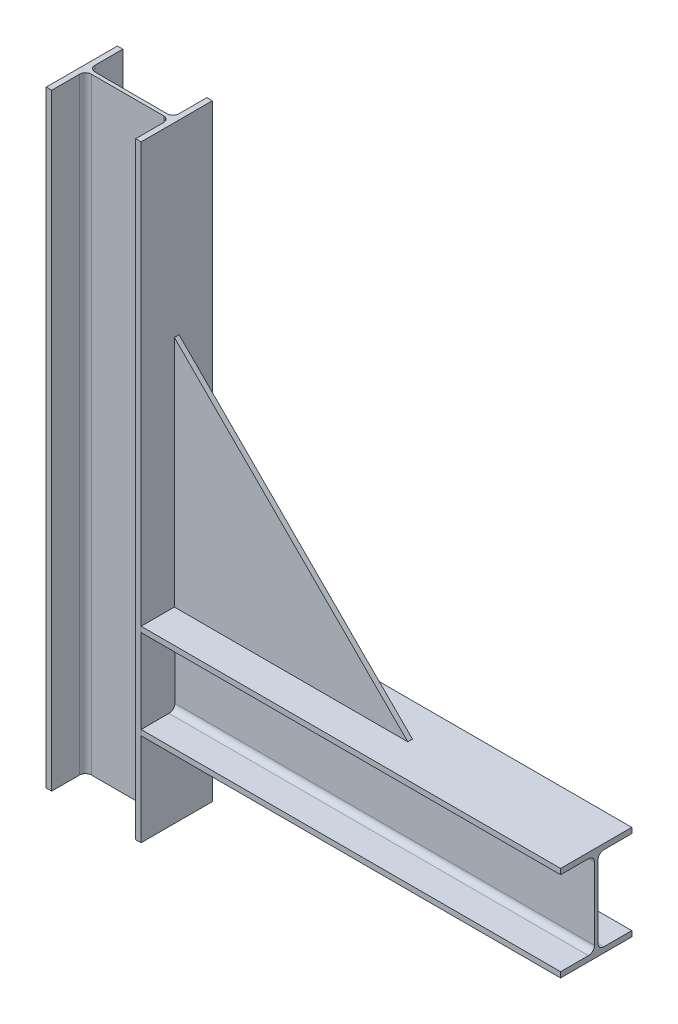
ISO-10303-21;
HEADER;
FILE_DESCRIPTION(('STEP AP214'),'2;1');
FILE_NAME('part.step','',(''),(''),'','','');
FILE_SCHEMA(('AUTOMOTIVE_DESIGN { 1 0 10303 214 1 1 1 1 }'));
ENDSEC;
DATA;
#1=APPLICATION_CONTEXT('core data for automotive mechanical design processes');
#2=APPLICATION_PROTOCOL_DEFINITION('international standard','automotive_design',2000,#1);
#3=PRODUCT_CONTEXT('',#1,'mechanical');
#4=PRODUCT('Part','Part','',(#3));
#5=PRODUCT_RELATED_PRODUCT_CATEGORY('part','',(#4));
#6=PRODUCT_DEFINITION_FORMATION('','',#4);
#7=PRODUCT_DEFINITION_CONTEXT('part definition',#1,'design');
#8=PRODUCT_DEFINITION('design','',#6,#7);
#9=PRODUCT_DEFINITION_SHAPE('','',#8);
#10=(LENGTH_UNIT() NAMED_UNIT(*) SI_UNIT(.MILLI.,.METRE.));
#11=(NAMED_UNIT(*) PLANE_ANGLE_UNIT() SI_UNIT($,.RADIAN.));
#12=(NAMED_UNIT(*) SI_UNIT($,.STERADIAN.) SOLID_ANGLE_UNIT());
#13=UNCERTAINTY_MEASURE_WITH_UNIT(LENGTH_MEASURE(1.E-05),#10,'distance_accuracy_value','');
#14=(GEOMETRIC_REPRESENTATION_CONTEXT(3) GLOBAL_UNCERTAINTY_ASSIGNED_CONTEXT((#13)) GLOBAL_UNIT_ASSIGNED_CONTEXT((#10,
#11,#12)) REPRESENTATION_CONTEXT('',''));
#15=CARTESIAN_POINT('',(0.,0.,0.));
#16=DIRECTION('',(0.,0.,1.));
#17=DIRECTION('',(1.,0.,0.));
#18=AXIS2_PLACEMENT_3D('',#15,#16,#17);
#19=CARTESIAN_POINT('',(50.8,300.8,2.50000000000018));
#20=DIRECTION('',(-0.707106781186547,-0.707106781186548,0.));
#21=DIRECTION('',(0.707106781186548,-0.707106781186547,0.));
#22=AXIS2_PLACEMENT_3D('',#19,#20,#21);
#23=PLANE('',#22);
#24=DIRECTION('',(-0.707106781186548,0.707106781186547,0.));
#25=VECTOR('',#24,1.);
#26=CARTESIAN_POINT('',(50.8,300.8,-2.49999999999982));
#27=LINE('',#26,#25);
#28=CARTESIAN_POINT('',(300.8,50.8,-2.49999999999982));
#29=VERTEX_POINT('',#28);
#30=CARTESIAN_POINT('',(50.8,300.8,-2.49999999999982));
#31=VERTEX_POINT('',#30);
#32=EDGE_CURVE('E163',#29,#31,#27,.T.);
#33=ORIENTED_EDGE('',*,*,#32,.T.);
#34=DIRECTION('',(0.,0.,-1.));
#35=VECTOR('',#34,1.);
#36=CARTESIAN_POINT('',(50.8,300.8,2.50000000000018));
#37=LINE('',#36,#35);
#38=CARTESIAN_POINT('',(50.8,300.8,2.50000000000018));
#39=VERTEX_POINT('',#38);
#40=EDGE_CURVE('E14',#39,#31,#37,.T.);
#41=ORIENTED_EDGE('',*,*,#40,.F.);
#42=DIRECTION('',(-0.707106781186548,0.707106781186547,0.));
#43=VECTOR('',#42,1.);
#44=CARTESIAN_POINT('',(50.8,300.8,2.50000000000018));
#45=LINE('',#44,#43);
#46=CARTESIAN_POINT('',(300.8,50.8,2.50000000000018));
#47=VERTEX_POINT('',#46);
#48=EDGE_CURVE('E156',#47,#39,#45,.T.);
#49=ORIENTED_EDGE('',*,*,#48,.F.);
#50=DIRECTION('',(0.,0.,-1.));
#51=VECTOR('',#50,1.);
#52=CARTESIAN_POINT('',(300.8,50.8,2.50000000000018));
#53=LINE('',#52,#51);
#54=EDGE_CURVE('E164',#47,#29,#53,.T.);
#55=ORIENTED_EDGE('',*,*,#54,.T.);
#56=EDGE_LOOP('',(#33,#41,#49,#55));
#57=FACE_BOUND('',#56,.T.);
#58=ADVANCED_FACE('F116',(#57),#23,.F.);
#59=CARTESIAN_POINT('',(50.8000000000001,50.8,2.50000000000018));
#60=DIRECTION('',(1.,0.,0.));
#61=DIRECTION('',(0.,1.,0.));
#62=AXIS2_PLACEMENT_3D('',#59,#60,#61);
#63=PLANE('',#62);
#64=DIRECTION('',(0.,-1.,0.));
#65=VECTOR('',#64,1.);
#66=CARTESIAN_POINT('',(50.8000000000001,50.8,-2.49999999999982));
#67=LINE('',#66,#65);
#68=CARTESIAN_POINT('',(50.8000000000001,50.8,-2.49999999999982));
#69=VERTEX_POINT('',#68);
#70=EDGE_CURVE('E144',#31,#69,#67,.T.);
#71=ORIENTED_EDGE('',*,*,#70,.T.);
#72=DIRECTION('',(0.,0.,-1.));
#73=VECTOR('',#72,1.);
#74=CARTESIAN_POINT('',(50.8000000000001,50.8,2.50000000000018));
#75=LINE('',#74,#73);
#76=CARTESIAN_POINT('',(50.8000000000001,50.8,2.50000000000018));
#77=VERTEX_POINT('',#76);
#78=EDGE_CURVE('E124',#77,#69,#75,.T.);
#79=ORIENTED_EDGE('',*,*,#78,.F.);
#80=DIRECTION('',(0.,-1.,0.));
#81=VECTOR('',#80,1.);
#82=CARTESIAN_POINT('',(50.8000000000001,50.8,2.50000000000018));
#83=LINE('',#82,#81);
#84=EDGE_CURVE('E152',#39,#77,#83,.T.);
#85=ORIENTED_EDGE('',*,*,#84,.F.);
#86=ORIENTED_EDGE('',*,*,#40,.T.);
#87=EDGE_LOOP('',(#71,#79,#85,#86));
#88=FACE_BOUND('',#87,.T.);
#89=ADVANCED_FACE('F153',(#88),#63,.F.);
#90=CARTESIAN_POINT('',(50.8000000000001,50.8,2.50000000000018));
#91=DIRECTION('',(0.,1.,0.));
#92=DIRECTION('',(0.,0.,1.));
#93=AXIS2_PLACEMENT_3D('',#90,#91,#92);
#94=PLANE('',#93);
#95=DIRECTION('',(1.,0.,0.));
#96=VECTOR('',#95,1.);
#97=CARTESIAN_POINT('',(50.8000000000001,50.8,-2.49999999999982));
#98=LINE('',#97,#96);
#99=EDGE_CURVE('E149',#69,#29,#98,.T.);
#100=ORIENTED_EDGE('',*,*,#99,.T.);
#101=ORIENTED_EDGE('',*,*,#54,.F.);
#102=DIRECTION('',(1.,0.,0.));
#103=VECTOR('',#102,1.);
#104=CARTESIAN_POINT('',(50.8000000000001,50.8,2.50000000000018));
#105=LINE('',#104,#103);
#106=EDGE_CURVE('E132',#77,#47,#105,.T.);
#107=ORIENTED_EDGE('',*,*,#106,.F.);
#108=ORIENTED_EDGE('',*,*,#78,.T.);
#109=EDGE_LOOP('',(#100,#101,#107,#108));
#110=FACE_BOUND('',#109,.T.);
#111=ADVANCED_FACE('F171',(#110),#94,.F.);
#112=CARTESIAN_POINT('',(0.,0.,2.50000000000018));
#113=DIRECTION('',(0.,0.,1.));
#114=DIRECTION('',(1.,0.,0.));
#115=AXIS2_PLACEMENT_3D('',#112,#113,#114);
#116=PLANE('',#115);
#117=ORIENTED_EDGE('',*,*,#48,.T.);
#118=ORIENTED_EDGE('',*,*,#84,.T.);
#119=ORIENTED_EDGE('',*,*,#106,.T.);
#120=EDGE_LOOP('',(#117,#118,#119));
#121=FACE_BOUND('',#120,.T.);
#122=ADVANCED_FACE('F159',(#121),#116,.T.);
#123=CARTESIAN_POINT('',(0.,0.,-2.49999999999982));
#124=DIRECTION('',(0.,0.,1.));
#125=DIRECTION('',(1.,0.,0.));
#126=AXIS2_PLACEMENT_3D('',#123,#124,#125);
#127=PLANE('',#126);
#128=ORIENTED_EDGE('',*,*,#32,.F.);
#129=ORIENTED_EDGE('',*,*,#99,.F.);
#130=ORIENTED_EDGE('',*,*,#70,.F.);
#131=EDGE_LOOP('',(#128,#129,#130));
#132=FACE_BOUND('',#131,.T.);
#133=ADVANCED_FACE('F172',(#132),#127,.F.);
#134=CLOSED_SHELL('',(#58,#89,#111,#122,#133));
#135=MANIFOLD_SOLID_BREP('B2',#134);
#136=CARTESIAN_POINT('',(500.,50.7999999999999,38.1000000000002));
#137=DIRECTION('',(0.,-1.,0.));
#138=DIRECTION('',(0.,0.,-1.));
#139=AXIS2_PLACEMENT_3D('',#136,#137,#138);
#140=PLANE('',#139);
#141=DIRECTION('',(0.,0.,-1.));
#142=VECTOR('',#141,1.);
#143=CARTESIAN_POINT('',(50.7999999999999,50.7999999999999,38.0999999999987));
#144=LINE('',#143,#142);
#145=CARTESIAN_POINT('',(50.7999999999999,50.7999999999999,38.1000000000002));
#146=VERTEX_POINT('',#145);
#147=CARTESIAN_POINT('',(50.8000000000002,50.8000000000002,-38.0999999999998));
#148=VERTEX_POINT('',#147);
#149=EDGE_CURVE('E347',#146,#148,#144,.T.);
#150=ORIENTED_EDGE('',*,*,#149,.F.);
#151=DIRECTION('',(-1.,0.,0.));
#152=VECTOR('',#151,1.);
#153=CARTESIAN_POINT('',(500.,50.7999999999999,38.1000000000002));
#154=LINE('',#153,#152);
#155=CARTESIAN_POINT('',(500.,50.7999999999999,38.1000000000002));
#156=VERTEX_POINT('',#155);
#157=EDGE_CURVE('E370',#156,#146,#154,.T.);
#158=ORIENTED_EDGE('',*,*,#157,.F.);
#159=DIRECTION('',(0.,0.,1.));
#160=VECTOR('',#159,1.);
#161=CARTESIAN_POINT('',(500.,50.7999999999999,38.1000000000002));
#162=LINE('',#161,#160);
#163=CARTESIAN_POINT('',(500.,50.8000000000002,-38.0999999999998));
#164=VERTEX_POINT('',#163);
#165=EDGE_CURVE('E369',#164,#156,#162,.T.);
#166=ORIENTED_EDGE('',*,*,#165,.F.);
#167=DIRECTION('',(-1.,0.,0.));
#168=VECTOR('',#167,1.);
#169=CARTESIAN_POINT('',(500.,50.8000000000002,-38.0999999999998));
#170=LINE('',#169,#168);
#171=EDGE_CURVE('E363',#164,#148,#170,.T.);
#172=ORIENTED_EDGE('',*,*,#171,.T.);
#173=EDGE_LOOP('',(#150,#158,#166,#172));
#174=FACE_BOUND('',#173,.T.);
#175=ADVANCED_FACE('F233',(#174),#140,.F.);
#176=CARTESIAN_POINT('',(500.,44.9579999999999,38.1000000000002));
#177=DIRECTION('',(0.,0.,-1.));
#178=DIRECTION('',(0.,1.,0.));
#179=AXIS2_PLACEMENT_3D('',#176,#177,#178);
#180=PLANE('',#179);
#181=DIRECTION('',(0.,1.,0.));
#182=VECTOR('',#181,1.);
#183=CARTESIAN_POINT('',(50.8,-150.,38.1000000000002));
#184=LINE('',#183,#182);
#185=CARTESIAN_POINT('',(50.7999999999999,44.9579999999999,38.1000000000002));
#186=VERTEX_POINT('',#185);
#187=EDGE_CURVE('E114',#186,#146,#184,.T.);
#188=ORIENTED_EDGE('',*,*,#187,.F.);
#189=DIRECTION('',(-1.,0.,0.));
#190=VECTOR('',#189,1.);
#191=CARTESIAN_POINT('',(500.,44.9579999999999,38.1000000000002));
#192=LINE('',#191,#190);
#193=CARTESIAN_POINT('',(500.,44.9579999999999,38.1000000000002));
#194=VERTEX_POINT('',#193);
#195=EDGE_CURVE('E372',#194,#186,#192,.T.);
#196=ORIENTED_EDGE('',*,*,#195,.F.);
#197=DIRECTION('',(0.,-1.,0.));
#198=VECTOR('',#197,1.);
#199=CARTESIAN_POINT('',(500.,44.9579999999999,38.1000000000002));
#200=LINE('',#199,#198);
#201=EDGE_CURVE('E385',#156,#194,#200,.T.);
#202=ORIENTED_EDGE('',*,*,#201,.F.);
#203=ORIENTED_EDGE('',*,*,#157,.T.);
#204=EDGE_LOOP('',(#188,#196,#202,#203));
#205=FACE_BOUND('',#204,.T.);
#206=ADVANCED_FACE('F501',(#205),#180,.F.);
#207=CARTESIAN_POINT('',(500.,44.9579999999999,8.25500000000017));
#208=DIRECTION('',(0.,1.,0.));
#209=DIRECTION('',(0.,0.,1.));
#210=AXIS2_PLACEMENT_3D('',#207,#208,#209);
#211=PLANE('',#210);
#212=DIRECTION('',(0.,0.,1.));
#213=VECTOR('',#212,1.);
#214=CARTESIAN_POINT('',(50.8,44.9579999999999,8.25499999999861));
#215=LINE('',#214,#213);
#216=CARTESIAN_POINT('',(50.8,44.958,8.25500000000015));
#217=VERTEX_POINT('',#216);
#218=EDGE_CURVE('E242',#217,#186,#215,.T.);
#219=ORIENTED_EDGE('',*,*,#218,.F.);
#220=DIRECTION('',(-1.,0.,0.));
#221=VECTOR('',#220,1.);
#222=CARTESIAN_POINT('',(500.,44.958,8.25500000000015));
#223=LINE('',#222,#221);
#224=CARTESIAN_POINT('',(500.,44.958,8.25500000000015));
#225=VERTEX_POINT('',#224);
#226=EDGE_CURVE('E415',#225,#217,#223,.T.);
#227=ORIENTED_EDGE('',*,*,#226,.F.);
#228=DIRECTION('',(0.,0.,-1.));
#229=VECTOR('',#228,1.);
#230=CARTESIAN_POINT('',(500.,44.9579999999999,8.25500000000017));
#231=LINE('',#230,#229);
#232=EDGE_CURVE('E388',#194,#225,#231,.T.);
#233=ORIENTED_EDGE('',*,*,#232,.F.);
#234=ORIENTED_EDGE('',*,*,#195,.T.);
#235=EDGE_LOOP('',(#219,#227,#233,#234));
#236=FACE_BOUND('',#235,.T.);
#237=ADVANCED_FACE('F498',(#236),#211,.F.);
#238=CARTESIAN_POINT('',(500.,38.608,8.25500000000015));
#239=DIRECTION('',(-1.,0.,0.));
#240=DIRECTION('',(0.,0.,1.));
#241=AXIS2_PLACEMENT_3D('',#238,#239,#240);
#242=CYLINDRICAL_SURFACE('',#241,6.34999999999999);
#243=CARTESIAN_POINT('',(50.8,38.608,8.25500000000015));
#244=DIRECTION('',(-1.,0.,0.));
#245=DIRECTION('',(0.,0.,1.));
#246=AXIS2_PLACEMENT_3D('',#243,#244,#245);
#247=CIRCLE('',#246,6.34999999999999);
#248=CARTESIAN_POINT('',(50.8000000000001,38.608,1.90500000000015));
#249=VERTEX_POINT('',#248);
#250=EDGE_CURVE('E393',#249,#217,#247,.F.);
#251=ORIENTED_EDGE('',*,*,#250,.F.);
#252=DIRECTION('',(-1.,0.,0.));
#253=VECTOR('',#252,1.);
#254=CARTESIAN_POINT('',(500.,38.608,1.90500000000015));
#255=LINE('',#254,#253);
#256=CARTESIAN_POINT('',(500.,38.608,1.90500000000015));
#257=VERTEX_POINT('',#256);
#258=EDGE_CURVE('E418',#257,#249,#255,.T.);
#259=ORIENTED_EDGE('',*,*,#258,.F.);
#260=CARTESIAN_POINT('',(500.,38.608,8.25500000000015));
#261=DIRECTION('',(-1.,0.,0.));
#262=DIRECTION('',(0.,1.,0.));
#263=AXIS2_PLACEMENT_3D('',#260,#261,#262);
#264=CIRCLE('',#263,6.34999999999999);
#265=EDGE_CURVE('E495',#225,#257,#264,.T.);
#266=ORIENTED_EDGE('',*,*,#265,.F.);
#267=ORIENTED_EDGE('',*,*,#226,.T.);
#268=EDGE_LOOP('',(#251,#259,#266,#267));
#269=FACE_BOUND('',#268,.T.);
#270=ADVANCED_FACE('F492',(#269),#242,.F.);
#271=CARTESIAN_POINT('',(500.,-38.608,1.90499999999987));
#272=DIRECTION('',(0.,0.,-1.));
#273=DIRECTION('',(0.,1.,0.));
#274=AXIS2_PLACEMENT_3D('',#271,#272,#273);
#275=PLANE('',#274);
#276=DIRECTION('',(0.,1.,0.));
#277=VECTOR('',#276,1.);
#278=CARTESIAN_POINT('',(50.8000000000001,-38.6080000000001,1.90499999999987));
#279=LINE('',#278,#277);
#280=CARTESIAN_POINT('',(50.8000000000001,-38.608,1.90499999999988));
#281=VERTEX_POINT('',#280);
#282=EDGE_CURVE('E395',#281,#249,#279,.T.);
#283=ORIENTED_EDGE('',*,*,#282,.F.);
#284=DIRECTION('',(-1.,0.,0.));
#285=VECTOR('',#284,1.);
#286=CARTESIAN_POINT('',(500.,-38.608,1.90499999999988));
#287=LINE('',#286,#285);
#288=CARTESIAN_POINT('',(500.,-38.608,1.90499999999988));
#289=VERTEX_POINT('',#288);
#290=EDGE_CURVE('E421',#289,#281,#287,.T.);
#291=ORIENTED_EDGE('',*,*,#290,.F.);
#292=DIRECTION('',(0.,-1.,0.));
#293=VECTOR('',#292,1.);
#294=CARTESIAN_POINT('',(500.,-38.608,1.90499999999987));
#295=LINE('',#294,#293);
#296=EDGE_CURVE('E487',#257,#289,#295,.T.);
#297=ORIENTED_EDGE('',*,*,#296,.F.);
#298=ORIENTED_EDGE('',*,*,#258,.T.);
#299=EDGE_LOOP('',(#283,#291,#297,#298));
#300=FACE_BOUND('',#299,.T.);
#301=ADVANCED_FACE('F486',(#300),#275,.F.);
#302=CARTESIAN_POINT('',(500.,-38.608,8.25499999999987));
#303=DIRECTION('',(-1.,0.,0.));
#304=DIRECTION('',(0.,0.,1.));
#305=AXIS2_PLACEMENT_3D('',#302,#303,#304);
#306=CYLINDRICAL_SURFACE('',#305,6.34999999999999);
#307=CARTESIAN_POINT('',(50.8000000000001,-38.608,8.25499999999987));
#308=DIRECTION('',(-1.,0.,0.));
#309=DIRECTION('',(0.,0.,1.));
#310=AXIS2_PLACEMENT_3D('',#307,#308,#309);
#311=CIRCLE('',#310,6.34999999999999);
#312=CARTESIAN_POINT('',(50.8000000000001,-44.958,8.25499999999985));
#313=VERTEX_POINT('',#312);
#314=EDGE_CURVE('E397',#313,#281,#311,.F.);
#315=ORIENTED_EDGE('',*,*,#314,.F.);
#316=DIRECTION('',(-1.,0.,0.));
#317=VECTOR('',#316,1.);
#318=CARTESIAN_POINT('',(500.,-44.958,8.25499999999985));
#319=LINE('',#318,#317);
#320=CARTESIAN_POINT('',(500.,-44.958,8.25499999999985));
#321=VERTEX_POINT('',#320);
#322=EDGE_CURVE('E424',#321,#313,#319,.T.);
#323=ORIENTED_EDGE('',*,*,#322,.F.);
#324=CARTESIAN_POINT('',(500.,-38.608,8.25499999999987));
#325=DIRECTION('',(-1.,0.,0.));
#326=DIRECTION('',(0.,1.,0.));
#327=AXIS2_PLACEMENT_3D('',#324,#325,#326);
#328=CIRCLE('',#327,6.34999999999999);
#329=EDGE_CURVE('E483',#289,#321,#328,.T.);
#330=ORIENTED_EDGE('',*,*,#329,.F.);
#331=ORIENTED_EDGE('',*,*,#290,.T.);
#332=EDGE_LOOP('',(#315,#323,#330,#331));
#333=FACE_BOUND('',#332,.T.);
#334=ADVANCED_FACE('F480',(#333),#306,.F.);
#335=CARTESIAN_POINT('',(500.,-44.9580000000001,38.0999999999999));
#336=DIRECTION('',(0.,-1.,0.));
#337=DIRECTION('',(0.,0.,-1.));
#338=AXIS2_PLACEMENT_3D('',#335,#336,#337);
#339=PLANE('',#338);
#340=DIRECTION('',(0.,0.,-1.));
#341=VECTOR('',#340,1.);
#342=CARTESIAN_POINT('',(50.8,-44.9580000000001,38.0999999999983));
#343=LINE('',#342,#341);
#344=CARTESIAN_POINT('',(50.8,-44.9580000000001,38.1000000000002));
#345=VERTEX_POINT('',#344);
#346=EDGE_CURVE('E399',#345,#313,#343,.T.);
#347=ORIENTED_EDGE('',*,*,#346,.F.);
#348=DIRECTION('',(-1.,0.,0.));
#349=VECTOR('',#348,1.);
#350=CARTESIAN_POINT('',(500.,-44.9580000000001,38.0999999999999));
#351=LINE('',#350,#349);
#352=CARTESIAN_POINT('',(500.,-44.9580000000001,38.0999999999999));
#353=VERTEX_POINT('',#352);
#354=EDGE_CURVE('E427',#353,#345,#351,.T.);
#355=ORIENTED_EDGE('',*,*,#354,.F.);
#356=DIRECTION('',(0.,0.,1.));
#357=VECTOR('',#356,1.);
#358=CARTESIAN_POINT('',(500.,-44.9580000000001,38.0999999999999));
#359=LINE('',#358,#357);
#360=EDGE_CURVE('E475',#321,#353,#359,.T.);
#361=ORIENTED_EDGE('',*,*,#360,.F.);
#362=ORIENTED_EDGE('',*,*,#322,.T.);
#363=EDGE_LOOP('',(#347,#355,#361,#362));
#364=FACE_BOUND('',#363,.T.);
#365=ADVANCED_FACE('F474',(#364),#339,.F.);
#366=CARTESIAN_POINT('',(500.,-50.8000000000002,38.0999999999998));
#367=DIRECTION('',(0.,0.,-1.));
#368=DIRECTION('',(0.,1.,0.));
#369=AXIS2_PLACEMENT_3D('',#366,#367,#368);
#370=PLANE('',#369);
#371=CARTESIAN_POINT('',(50.8,-50.8000000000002,38.1000000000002));
#372=VERTEX_POINT('',#371);
#373=EDGE_CURVE('E244',#372,#345,#184,.T.);
#374=ORIENTED_EDGE('',*,*,#373,.F.);
#375=DIRECTION('',(-1.,0.,0.));
#376=VECTOR('',#375,1.);
#377=CARTESIAN_POINT('',(500.,-50.8000000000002,38.0999999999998));
#378=LINE('',#377,#376);
#379=CARTESIAN_POINT('',(500.,-50.8000000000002,38.0999999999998));
#380=VERTEX_POINT('',#379);
#381=EDGE_CURVE('E411',#380,#372,#378,.T.);
#382=ORIENTED_EDGE('',*,*,#381,.F.);
#383=DIRECTION('',(0.,-1.,0.));
#384=VECTOR('',#383,1.);
#385=CARTESIAN_POINT('',(500.,-50.8000000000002,38.0999999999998));
#386=LINE('',#385,#384);
#387=EDGE_CURVE('E470',#353,#380,#386,.T.);
#388=ORIENTED_EDGE('',*,*,#387,.F.);
#389=ORIENTED_EDGE('',*,*,#354,.T.);
#390=EDGE_LOOP('',(#374,#382,#388,#389));
#391=FACE_BOUND('',#390,.T.);
#392=ADVANCED_FACE('F469',(#391),#370,.F.);
#393=CARTESIAN_POINT('',(500.,-50.7999999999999,-38.1000000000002));
#394=DIRECTION('',(0.,1.,0.));
#395=DIRECTION('',(0.,0.,1.));
#396=AXIS2_PLACEMENT_3D('',#393,#394,#395);
#397=PLANE('',#396);
#398=DIRECTION('',(0.,0.,1.));
#399=VECTOR('',#398,1.);
#400=CARTESIAN_POINT('',(50.8000000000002,-50.7999999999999,-38.1000000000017));
#401=LINE('',#400,#399);
#402=CARTESIAN_POINT('',(50.8000000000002,-50.7999999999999,-38.0999999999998));
#403=VERTEX_POINT('',#402);
#404=EDGE_CURVE('E268',#403,#372,#401,.T.);
#405=ORIENTED_EDGE('',*,*,#404,.F.);
#406=DIRECTION('',(-1.,0.,0.));
#407=VECTOR('',#406,1.);
#408=CARTESIAN_POINT('',(500.,-50.7999999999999,-38.1000000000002));
#409=LINE('',#408,#407);
#410=CARTESIAN_POINT('',(500.,-50.7999999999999,-38.1000000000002));
#411=VERTEX_POINT('',#410);
#412=EDGE_CURVE('E410',#411,#403,#409,.T.);
#413=ORIENTED_EDGE('',*,*,#412,.F.);
#414=DIRECTION('',(0.,0.,-1.));
#415=VECTOR('',#414,1.);
#416=CARTESIAN_POINT('',(500.,-50.7999999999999,-38.1000000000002));
#417=LINE('',#416,#415);
#418=EDGE_CURVE('E465',#380,#411,#417,.T.);
#419=ORIENTED_EDGE('',*,*,#418,.F.);
#420=ORIENTED_EDGE('',*,*,#381,.T.);
#421=EDGE_LOOP('',(#405,#413,#419,#420));
#422=FACE_BOUND('',#421,.T.);
#423=ADVANCED_FACE('F464',(#422),#397,.F.);
#424=CARTESIAN_POINT('',(500.,-44.9579999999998,-38.1000000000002));
#425=DIRECTION('',(0.,0.,1.));
#426=DIRECTION('',(0.,-1.,0.));
#427=AXIS2_PLACEMENT_3D('',#424,#425,#426);
#428=PLANE('',#427);
#429=DIRECTION('',(0.,1.,0.));
#430=VECTOR('',#429,1.);
#431=CARTESIAN_POINT('',(50.8000000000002,-150.,-38.0999999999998));
#432=LINE('',#431,#430);
#433=CARTESIAN_POINT('',(50.8000000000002,-44.9579999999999,-38.0999999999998));
#434=VERTEX_POINT('',#433);
#435=EDGE_CURVE('E272',#403,#434,#432,.T.);
#436=ORIENTED_EDGE('',*,*,#435,.T.);
#437=DIRECTION('',(-1.,0.,0.));
#438=VECTOR('',#437,1.);
#439=CARTESIAN_POINT('',(500.,-44.9579999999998,-38.1000000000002));
#440=LINE('',#439,#438);
#441=CARTESIAN_POINT('',(500.,-44.9579999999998,-38.1000000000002));
#442=VERTEX_POINT('',#441);
#443=EDGE_CURVE('E434',#442,#434,#440,.T.);
#444=ORIENTED_EDGE('',*,*,#443,.F.);
#445=DIRECTION('',(0.,1.,0.));
#446=VECTOR('',#445,1.);
#447=CARTESIAN_POINT('',(500.,-44.9579999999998,-38.1000000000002));
#448=LINE('',#447,#446);
#449=EDGE_CURVE('E460',#411,#442,#448,.T.);
#450=ORIENTED_EDGE('',*,*,#449,.F.);
#451=ORIENTED_EDGE('',*,*,#412,.T.);
#452=EDGE_LOOP('',(#436,#444,#450,#451));
#453=FACE_BOUND('',#452,.T.);
#454=ADVANCED_FACE('F459',(#453),#428,.F.);
#455=CARTESIAN_POINT('',(500.,-44.9579999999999,-8.25500000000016));
#456=DIRECTION('',(0.,-1.,0.));
#457=DIRECTION('',(0.,0.,-1.));
#458=AXIS2_PLACEMENT_3D('',#455,#456,#457);
#459=PLANE('',#458);
#460=DIRECTION('',(0.,0.,-1.));
#461=VECTOR('',#460,1.);
#462=CARTESIAN_POINT('',(50.8000000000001,-44.9579999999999,-8.25500000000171));
#463=LINE('',#462,#461);
#464=CARTESIAN_POINT('',(50.8000000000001,-44.958,-8.25500000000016));
#465=VERTEX_POINT('',#464);
#466=EDGE_CURVE('E276',#465,#434,#463,.T.);
#467=ORIENTED_EDGE('',*,*,#466,.F.);
#468=DIRECTION('',(-1.,0.,0.));
#469=VECTOR('',#468,1.);
#470=CARTESIAN_POINT('',(500.,-44.958,-8.25500000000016));
#471=LINE('',#470,#469);
#472=CARTESIAN_POINT('',(500.,-44.958,-8.25500000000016));
#473=VERTEX_POINT('',#472);
#474=EDGE_CURVE('E436',#473,#465,#471,.T.);
#475=ORIENTED_EDGE('',*,*,#474,.F.);
#476=DIRECTION('',(0.,0.,1.));
#477=VECTOR('',#476,1.);
#478=CARTESIAN_POINT('',(500.,-44.9579999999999,-8.25500000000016));
#479=LINE('',#478,#477);
#480=EDGE_CURVE('E456',#442,#473,#479,.T.);
#481=ORIENTED_EDGE('',*,*,#480,.F.);
#482=ORIENTED_EDGE('',*,*,#443,.T.);
#483=EDGE_LOOP('',(#467,#475,#481,#482));
#484=FACE_BOUND('',#483,.T.);
#485=ADVANCED_FACE('F453',(#484),#459,.F.);
#486=CARTESIAN_POINT('',(500.,-38.608,-8.25500000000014));
#487=DIRECTION('',(-1.,0.,0.));
#488=DIRECTION('',(0.,0.,1.));
#489=AXIS2_PLACEMENT_3D('',#486,#487,#488);
#490=CYLINDRICAL_SURFACE('',#489,6.34999999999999);
#491=CARTESIAN_POINT('',(50.8000000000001,-38.608,-8.25500000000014));
#492=DIRECTION('',(-1.,0.,0.));
#493=DIRECTION('',(0.,0.,1.));
#494=AXIS2_PLACEMENT_3D('',#491,#492,#493);
#495=CIRCLE('',#494,6.34999999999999);
#496=CARTESIAN_POINT('',(50.8,-38.608,-1.90500000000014));
#497=VERTEX_POINT('',#496);
#498=EDGE_CURVE('E403',#497,#465,#495,.F.);
#499=ORIENTED_EDGE('',*,*,#498,.F.);
#500=DIRECTION('',(-1.,0.,0.));
#501=VECTOR('',#500,1.);
#502=CARTESIAN_POINT('',(500.,-38.608,-1.90500000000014));
#503=LINE('',#502,#501);
#504=CARTESIAN_POINT('',(500.,-38.608,-1.90500000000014));
#505=VERTEX_POINT('',#504);
#506=EDGE_CURVE('E376',#505,#497,#503,.T.);
#507=ORIENTED_EDGE('',*,*,#506,.F.);
#508=CARTESIAN_POINT('',(500.,-38.608,-8.25500000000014));
#509=DIRECTION('',(-1.,0.,0.));
#510=DIRECTION('',(0.,1.,0.));
#511=AXIS2_PLACEMENT_3D('',#508,#509,#510);
#512=CIRCLE('',#511,6.34999999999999);
#513=EDGE_CURVE('E451',#473,#505,#512,.T.);
#514=ORIENTED_EDGE('',*,*,#513,.F.);
#515=ORIENTED_EDGE('',*,*,#474,.T.);
#516=EDGE_LOOP('',(#499,#507,#514,#515));
#517=FACE_BOUND('',#516,.T.);
#518=ADVANCED_FACE('F450',(#517),#490,.F.);
#519=CARTESIAN_POINT('',(500.,38.608,-1.90499999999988));
#520=DIRECTION('',(0.,0.,1.));
#521=DIRECTION('',(0.,-1.,0.));
#522=AXIS2_PLACEMENT_3D('',#519,#520,#521);
#523=PLANE('',#522);
#524=DIRECTION('',(0.,-1.,0.));
#525=VECTOR('',#524,1.);
#526=CARTESIAN_POINT('',(50.8,38.6079999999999,-1.90499999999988));
#527=LINE('',#526,#525);
#528=CARTESIAN_POINT('',(50.8,38.608,-1.90499999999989));
#529=VERTEX_POINT('',#528);
#530=EDGE_CURVE('E405',#529,#497,#527,.T.);
#531=ORIENTED_EDGE('',*,*,#530,.F.);
#532=DIRECTION('',(-1.,0.,0.));
#533=VECTOR('',#532,1.);
#534=CARTESIAN_POINT('',(500.,38.608,-1.90499999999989));
#535=LINE('',#534,#533);
#536=CARTESIAN_POINT('',(500.,38.608,-1.90499999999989));
#537=VERTEX_POINT('',#536);
#538=EDGE_CURVE('E378',#537,#529,#535,.T.);
#539=ORIENTED_EDGE('',*,*,#538,.F.);
#540=DIRECTION('',(0.,1.,0.));
#541=VECTOR('',#540,1.);
#542=CARTESIAN_POINT('',(500.,38.608,-1.90499999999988));
#543=LINE('',#542,#541);
#544=EDGE_CURVE('E449',#505,#537,#543,.T.);
#545=ORIENTED_EDGE('',*,*,#544,.F.);
#546=ORIENTED_EDGE('',*,*,#506,.T.);
#547=EDGE_LOOP('',(#531,#539,#545,#546));
#548=FACE_BOUND('',#547,.T.);
#549=ADVANCED_FACE('F447',(#548),#523,.F.);
#550=CARTESIAN_POINT('',(500.,38.608,-8.25499999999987));
#551=DIRECTION('',(-1.,0.,0.));
#552=DIRECTION('',(0.,0.,1.));
#553=AXIS2_PLACEMENT_3D('',#550,#551,#552);
#554=CYLINDRICAL_SURFACE('',#553,6.34999999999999);
#555=CARTESIAN_POINT('',(50.8000000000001,38.608,-8.25499999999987));
#556=DIRECTION('',(-1.,0.,0.));
#557=DIRECTION('',(0.,0.,1.));
#558=AXIS2_PLACEMENT_3D('',#555,#556,#557);
#559=CIRCLE('',#558,6.34999999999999);
#560=CARTESIAN_POINT('',(50.8000000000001,44.958,-8.25499999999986));
#561=VERTEX_POINT('',#560);
#562=EDGE_CURVE('E407',#561,#529,#559,.F.);
#563=ORIENTED_EDGE('',*,*,#562,.F.);
#564=DIRECTION('',(-1.,0.,0.));
#565=VECTOR('',#564,1.);
#566=CARTESIAN_POINT('',(500.,44.958,-8.25499999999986));
#567=LINE('',#566,#565);
#568=CARTESIAN_POINT('',(500.,44.958,-8.25499999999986));
#569=VERTEX_POINT('',#568);
#570=EDGE_CURVE('E380',#569,#561,#567,.T.);
#571=ORIENTED_EDGE('',*,*,#570,.F.);
#572=CARTESIAN_POINT('',(500.,38.608,-8.25499999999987));
#573=DIRECTION('',(-1.,0.,0.));
#574=DIRECTION('',(0.,1.,0.));
#575=AXIS2_PLACEMENT_3D('',#572,#573,#574);
#576=CIRCLE('',#575,6.34999999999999);
#577=EDGE_CURVE('E514',#537,#569,#576,.T.);
#578=ORIENTED_EDGE('',*,*,#577,.F.);
#579=ORIENTED_EDGE('',*,*,#538,.T.);
#580=EDGE_LOOP('',(#563,#571,#578,#579));
#581=FACE_BOUND('',#580,.T.);
#582=ADVANCED_FACE('F522',(#581),#554,.F.);
#583=CARTESIAN_POINT('',(500.,44.9580000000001,-38.0999999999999));
#584=DIRECTION('',(0.,1.,0.));
#585=DIRECTION('',(0.,0.,1.));
#586=AXIS2_PLACEMENT_3D('',#583,#584,#585);
#587=PLANE('',#586);
#588=DIRECTION('',(0.,0.,1.));
#589=VECTOR('',#588,1.);
#590=CARTESIAN_POINT('',(50.8000000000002,44.9580000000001,-38.1000000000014));
#591=LINE('',#590,#589);
#592=CARTESIAN_POINT('',(50.8000000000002,44.9580000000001,-38.0999999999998));
#593=VERTEX_POINT('',#592);
#594=EDGE_CURVE('E366',#593,#561,#591,.T.);
#595=ORIENTED_EDGE('',*,*,#594,.F.);
#596=DIRECTION('',(-1.,0.,0.));
#597=VECTOR('',#596,1.);
#598=CARTESIAN_POINT('',(500.,44.9580000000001,-38.0999999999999));
#599=LINE('',#598,#597);
#600=CARTESIAN_POINT('',(500.,44.9580000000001,-38.0999999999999));
#601=VERTEX_POINT('',#600);
#602=EDGE_CURVE('E236',#601,#593,#599,.T.);
#603=ORIENTED_EDGE('',*,*,#602,.F.);
#604=DIRECTION('',(0.,0.,-1.));
#605=VECTOR('',#604,1.);
#606=CARTESIAN_POINT('',(500.,44.9580000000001,-38.0999999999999));
#607=LINE('',#606,#605);
#608=EDGE_CURVE('E516',#569,#601,#607,.T.);
#609=ORIENTED_EDGE('',*,*,#608,.F.);
#610=ORIENTED_EDGE('',*,*,#570,.T.);
#611=EDGE_LOOP('',(#595,#603,#609,#610));
#612=FACE_BOUND('',#611,.T.);
#613=ADVANCED_FACE('F519',(#612),#587,.F.);
#614=CARTESIAN_POINT('',(500.,50.8000000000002,-38.0999999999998));
#615=DIRECTION('',(0.,0.,1.));
#616=DIRECTION('',(0.,-1.,0.));
#617=AXIS2_PLACEMENT_3D('',#614,#615,#616);
#618=PLANE('',#617);
#619=DIRECTION('',(0.,-1.,0.));
#620=VECTOR('',#619,1.);
#621=CARTESIAN_POINT('',(50.8000000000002,50.8000000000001,-38.0999999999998));
#622=LINE('',#621,#620);
#623=EDGE_CURVE('E350',#148,#593,#622,.T.);
#624=ORIENTED_EDGE('',*,*,#623,.F.);
#625=ORIENTED_EDGE('',*,*,#171,.F.);
#626=DIRECTION('',(0.,1.,0.));
#627=VECTOR('',#626,1.);
#628=CARTESIAN_POINT('',(500.,50.8000000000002,-38.0999999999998));
#629=LINE('',#628,#627);
#630=EDGE_CURVE('E356',#601,#164,#629,.T.);
#631=ORIENTED_EDGE('',*,*,#630,.F.);
#632=ORIENTED_EDGE('',*,*,#602,.T.);
#633=EDGE_LOOP('',(#624,#625,#631,#632));
#634=FACE_BOUND('',#633,.T.);
#635=ADVANCED_FACE('F361',(#634),#618,.F.);
#636=CARTESIAN_POINT('',(500.,38.608,-8.25499999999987));
#637=DIRECTION('',(1.,0.,0.));
#638=DIRECTION('',(0.,1.,0.));
#639=AXIS2_PLACEMENT_3D('',#636,#637,#638);
#640=PLANE('',#639);
#641=ORIENTED_EDGE('',*,*,#165,.T.);
#642=ORIENTED_EDGE('',*,*,#201,.T.);
#643=ORIENTED_EDGE('',*,*,#232,.T.);
#644=ORIENTED_EDGE('',*,*,#265,.T.);
#645=ORIENTED_EDGE('',*,*,#296,.T.);
#646=ORIENTED_EDGE('',*,*,#329,.T.);
#647=ORIENTED_EDGE('',*,*,#360,.T.);
#648=ORIENTED_EDGE('',*,*,#387,.T.);
#649=ORIENTED_EDGE('',*,*,#418,.T.);
#650=ORIENTED_EDGE('',*,*,#449,.T.);
#651=ORIENTED_EDGE('',*,*,#480,.T.);
#652=ORIENTED_EDGE('',*,*,#513,.T.);
#653=ORIENTED_EDGE('',*,*,#544,.T.);
#654=ORIENTED_EDGE('',*,*,#577,.T.);
#655=ORIENTED_EDGE('',*,*,#608,.T.);
#656=ORIENTED_EDGE('',*,*,#630,.T.);
#657=EDGE_LOOP('',(#641,#642,#643,#644,#645,#646,#647,#648,#649,#650,#651,#652,#653,#654,#655,#656));
#658=FACE_BOUND('',#657,.T.);
#659=ADVANCED_FACE('F502',(#658),#640,.T.);
#660=CARTESIAN_POINT('',(50.8,-150.,38.1000000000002));
#661=DIRECTION('',(-1.,0.,0.));
#662=DIRECTION('',(0.,0.,1.));
#663=AXIS2_PLACEMENT_3D('',#660,#661,#662);
#664=PLANE('',#663);
#665=ORIENTED_EDGE('',*,*,#149,.T.);
#666=ORIENTED_EDGE('',*,*,#623,.T.);
#667=ORIENTED_EDGE('',*,*,#594,.T.);
#668=ORIENTED_EDGE('',*,*,#562,.T.);
#669=ORIENTED_EDGE('',*,*,#530,.T.);
#670=ORIENTED_EDGE('',*,*,#498,.T.);
#671=ORIENTED_EDGE('',*,*,#466,.T.);
#672=ORIENTED_EDGE('',*,*,#435,.F.);
#673=ORIENTED_EDGE('',*,*,#404,.T.);
#674=ORIENTED_EDGE('',*,*,#373,.T.);
#675=ORIENTED_EDGE('',*,*,#346,.T.);
#676=ORIENTED_EDGE('',*,*,#314,.T.);
#677=ORIENTED_EDGE('',*,*,#282,.T.);
#678=ORIENTED_EDGE('',*,*,#250,.T.);
#679=ORIENTED_EDGE('',*,*,#218,.T.);
#680=ORIENTED_EDGE('',*,*,#187,.T.);
#681=EDGE_LOOP('',(#665,#666,#667,#668,#669,#670,#671,#672,#673,#674,#675,#676,#677,#678,#679,#680));
#682=FACE_BOUND('',#681,.T.);
#683=ADVANCED_FACE('F349',(#682),#664,.T.);
#684=CLOSED_SHELL('',(#175,#206,#237,#270,#301,#334,#365,#392,#423,#454,#485,#518,#549,#582,
#613,#635,#659,#683));
#685=MANIFOLD_SOLID_BREP('B8',#684);
#686=CARTESIAN_POINT('',(50.8,-150.,38.1000000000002));
#687=DIRECTION('',(-1.,0.,0.));
#688=DIRECTION('',(0.,0.,1.));
#689=AXIS2_PLACEMENT_3D('',#686,#687,#688);
#690=PLANE('',#689);
#691=DIRECTION('',(0.,0.,1.));
#692=VECTOR('',#691,1.);
#693=CARTESIAN_POINT('',(50.7999999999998,500.,38.1000000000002));
#694=LINE('',#693,#692);
#695=CARTESIAN_POINT('',(50.8000000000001,500.,-38.0999999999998));
#696=VERTEX_POINT('',#695);
#697=CARTESIAN_POINT('',(50.7999999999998,500.,38.1000000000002));
#698=VERTEX_POINT('',#697);
#699=EDGE_CURVE('E906',#696,#698,#694,.T.);
#700=ORIENTED_EDGE('',*,*,#699,.T.);
#701=DIRECTION('',(0.,1.,0.));
#702=VECTOR('',#701,1.);
#703=CARTESIAN_POINT('',(50.8,-150.,38.1000000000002));
#704=LINE('',#703,#702);
#705=CARTESIAN_POINT('',(50.8,-150.,38.1000000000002));
#706=VERTEX_POINT('',#705);
#707=EDGE_CURVE('E231',#706,#698,#704,.T.);
#708=ORIENTED_EDGE('',*,*,#707,.F.);
#709=DIRECTION('',(0.,0.,1.));
#710=VECTOR('',#709,1.);
#711=CARTESIAN_POINT('',(50.8,-150.,38.1000000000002));
#712=LINE('',#711,#710);
#713=CARTESIAN_POINT('',(50.8000000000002,-150.,-38.0999999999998));
#714=VERTEX_POINT('',#713);
#715=EDGE_CURVE('E952',#714,#706,#712,.T.);
#716=ORIENTED_EDGE('',*,*,#715,.F.);
#717=DIRECTION('',(0.,1.,0.));
#718=VECTOR('',#717,1.);
#719=CARTESIAN_POINT('',(50.8000000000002,-150.,-38.0999999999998));
#720=LINE('',#719,#718);
#721=EDGE_CURVE('E902',#714,#696,#720,.T.);
#722=ORIENTED_EDGE('',*,*,#721,.T.);
#723=EDGE_LOOP('',(#700,#708,#716,#722));
#724=FACE_BOUND('',#723,.T.);
#725=ADVANCED_FACE('F757',(#724),#690,.F.);
#726=CARTESIAN_POINT('',(44.9579999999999,-150.,38.1000000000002));
#727=DIRECTION('',(0.,0.,-1.));
#728=DIRECTION('',(-1.,0.,0.));
#729=AXIS2_PLACEMENT_3D('',#726,#727,#728);
#730=PLANE('',#729);
#731=DIRECTION('',(-1.,0.,0.));
#732=VECTOR('',#731,1.);
#733=CARTESIAN_POINT('',(44.9579999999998,500.,38.1000000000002));
#734=LINE('',#733,#732);
#735=CARTESIAN_POINT('',(44.9579999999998,500.,38.1000000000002));
#736=VERTEX_POINT('',#735);
#737=EDGE_CURVE('E910',#698,#736,#734,.T.);
#738=ORIENTED_EDGE('',*,*,#737,.T.);
#739=DIRECTION('',(0.,1.,0.));
#740=VECTOR('',#739,1.);
#741=CARTESIAN_POINT('',(44.9579999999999,-150.,38.1000000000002));
#742=LINE('',#741,#740);
#743=CARTESIAN_POINT('',(44.9579999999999,-150.,38.1000000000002));
#744=VERTEX_POINT('',#743);
#745=EDGE_CURVE('E766',#744,#736,#742,.T.);
#746=ORIENTED_EDGE('',*,*,#745,.F.);
#747=DIRECTION('',(-1.,0.,0.));
#748=VECTOR('',#747,1.);
#749=CARTESIAN_POINT('',(44.9579999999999,-150.,38.1000000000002));
#750=LINE('',#749,#748);
#751=EDGE_CURVE('E841',#706,#744,#750,.T.);
#752=ORIENTED_EDGE('',*,*,#751,.F.);
#753=ORIENTED_EDGE('',*,*,#707,.T.);
#754=EDGE_LOOP('',(#738,#746,#752,#753));
#755=FACE_BOUND('',#754,.T.);
#756=ADVANCED_FACE('F1074',(#755),#730,.F.);
#757=CARTESIAN_POINT('',(44.958,-150.,8.25500000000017));
#758=DIRECTION('',(1.,0.,0.));
#759=DIRECTION('',(0.,0.,-1.));
#760=AXIS2_PLACEMENT_3D('',#757,#758,#759);
#761=PLANE('',#760);
#762=DIRECTION('',(0.,0.,-1.));
#763=VECTOR('',#762,1.);
#764=CARTESIAN_POINT('',(44.9579999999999,500.,8.25500000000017));
#765=LINE('',#764,#763);
#766=CARTESIAN_POINT('',(44.9579999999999,500.,8.25500000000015));
#767=VERTEX_POINT('',#766);
#768=EDGE_CURVE('E913',#736,#767,#765,.T.);
#769=ORIENTED_EDGE('',*,*,#768,.T.);
#770=DIRECTION('',(0.,1.,0.));
#771=VECTOR('',#770,1.);
#772=CARTESIAN_POINT('',(44.958,-150.,8.25500000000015));
#773=LINE('',#772,#771);
#774=CARTESIAN_POINT('',(44.958,-150.,8.25500000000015));
#775=VERTEX_POINT('',#774);
#776=EDGE_CURVE('E995',#775,#767,#773,.T.);
#777=ORIENTED_EDGE('',*,*,#776,.F.);
#778=DIRECTION('',(0.,0.,-1.));
#779=VECTOR('',#778,1.);
#780=CARTESIAN_POINT('',(44.958,-150.,8.25500000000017));
#781=LINE('',#780,#779);
#782=EDGE_CURVE('E1005',#744,#775,#781,.T.);
#783=ORIENTED_EDGE('',*,*,#782,.F.);
#784=ORIENTED_EDGE('',*,*,#745,.T.);
#785=EDGE_LOOP('',(#769,#777,#783,#784));
#786=FACE_BOUND('',#785,.T.);
#787=ADVANCED_FACE('F1003',(#786),#761,.F.);
#788=CARTESIAN_POINT('',(38.6080000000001,-150.,8.25500000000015));
#789=DIRECTION('',(0.,1.,0.));
#790=DIRECTION('',(-1.,0.,0.));
#791=AXIS2_PLACEMENT_3D('',#788,#789,#790);
#792=CYLINDRICAL_SURFACE('',#791,6.34999999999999);
#793=CARTESIAN_POINT('',(38.6079999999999,500.,8.25500000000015));
#794=DIRECTION('',(0.,1.,0.));
#795=DIRECTION('',(1.,0.,0.));
#796=AXIS2_PLACEMENT_3D('',#793,#794,#795);
#797=CIRCLE('',#796,6.34999999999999);
#798=CARTESIAN_POINT('',(38.6079999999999,500.,1.90500000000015));
#799=VERTEX_POINT('',#798);
#800=EDGE_CURVE('E916',#767,#799,#797,.T.);
#801=ORIENTED_EDGE('',*,*,#800,.T.);
#802=DIRECTION('',(0.,1.,0.));
#803=VECTOR('',#802,1.);
#804=CARTESIAN_POINT('',(38.6080000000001,-150.,1.90500000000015));
#805=LINE('',#804,#803);
#806=CARTESIAN_POINT('',(38.6080000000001,-150.,1.90500000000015));
#807=VERTEX_POINT('',#806);
#808=EDGE_CURVE('E991',#807,#799,#805,.T.);
#809=ORIENTED_EDGE('',*,*,#808,.F.);
#810=CARTESIAN_POINT('',(38.6080000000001,-150.,8.25500000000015));
#811=DIRECTION('',(0.,1.,0.));
#812=DIRECTION('',(1.,0.,0.));
#813=AXIS2_PLACEMENT_3D('',#810,#811,#812);
#814=CIRCLE('',#813,6.34999999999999);
#815=EDGE_CURVE('E1024',#775,#807,#814,.T.);
#816=ORIENTED_EDGE('',*,*,#815,.F.);
#817=ORIENTED_EDGE('',*,*,#776,.T.);
#818=EDGE_LOOP('',(#801,#809,#816,#817));
#819=FACE_BOUND('',#818,.T.);
#820=ADVANCED_FACE('F1014',(#819),#792,.F.);
#821=CARTESIAN_POINT('',(-38.6079999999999,-150.,1.90499999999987));
#822=DIRECTION('',(0.,0.,-1.));
#823=DIRECTION('',(-1.,0.,0.));
#824=AXIS2_PLACEMENT_3D('',#821,#822,#823);
#825=PLANE('',#824);
#826=DIRECTION('',(-1.,0.,0.));
#827=VECTOR('',#826,1.);
#828=CARTESIAN_POINT('',(-38.6080000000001,500.,1.90499999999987));
#829=LINE('',#828,#827);
#830=CARTESIAN_POINT('',(-38.6080000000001,500.,1.90499999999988));
#831=VERTEX_POINT('',#830);
#832=EDGE_CURVE('E919',#799,#831,#829,.T.);
#833=ORIENTED_EDGE('',*,*,#832,.T.);
#834=DIRECTION('',(0.,1.,0.));
#835=VECTOR('',#834,1.);
#836=CARTESIAN_POINT('',(-38.6079999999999,-150.,1.90499999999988));
#837=LINE('',#836,#835);
#838=CARTESIAN_POINT('',(-38.6079999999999,-150.,1.90499999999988));
#839=VERTEX_POINT('',#838);
#840=EDGE_CURVE('E987',#839,#831,#837,.T.);
#841=ORIENTED_EDGE('',*,*,#840,.F.);
#842=DIRECTION('',(-1.,0.,0.));
#843=VECTOR('',#842,1.);
#844=CARTESIAN_POINT('',(-38.6079999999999,-150.,1.90499999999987));
#845=LINE('',#844,#843);
#846=EDGE_CURVE('E1020',#807,#839,#845,.T.);
#847=ORIENTED_EDGE('',*,*,#846,.F.);
#848=ORIENTED_EDGE('',*,*,#808,.T.);
#849=EDGE_LOOP('',(#833,#841,#847,#848));
#850=FACE_BOUND('',#849,.T.);
#851=ADVANCED_FACE('F1018',(#850),#825,.F.);
#852=CARTESIAN_POINT('',(-38.6079999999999,-150.,8.25499999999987));
#853=DIRECTION('',(0.,1.,0.));
#854=DIRECTION('',(-1.,0.,0.));
#855=AXIS2_PLACEMENT_3D('',#852,#853,#854);
#856=CYLINDRICAL_SURFACE('',#855,6.34999999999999);
#857=CARTESIAN_POINT('',(-38.6080000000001,500.,8.25499999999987));
#858=DIRECTION('',(0.,1.,0.));
#859=DIRECTION('',(1.,0.,0.));
#860=AXIS2_PLACEMENT_3D('',#857,#858,#859);
#861=CIRCLE('',#860,6.34999999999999);
#862=CARTESIAN_POINT('',(-44.9580000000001,500.,8.25499999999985));
#863=VERTEX_POINT('',#862);
#864=EDGE_CURVE('E922',#831,#863,#861,.T.);
#865=ORIENTED_EDGE('',*,*,#864,.T.);
#866=DIRECTION('',(0.,1.,0.));
#867=VECTOR('',#866,1.);
#868=CARTESIAN_POINT('',(-44.9579999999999,-150.,8.25499999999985));
#869=LINE('',#868,#867);
#870=CARTESIAN_POINT('',(-44.9579999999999,-150.,8.25499999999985));
#871=VERTEX_POINT('',#870);
#872=EDGE_CURVE('E983',#871,#863,#869,.T.);
#873=ORIENTED_EDGE('',*,*,#872,.F.);
#874=CARTESIAN_POINT('',(-38.6079999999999,-150.,8.25499999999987));
#875=DIRECTION('',(0.,1.,0.));
#876=DIRECTION('',(1.,0.,0.));
#877=AXIS2_PLACEMENT_3D('',#874,#875,#876);
#878=CIRCLE('',#877,6.34999999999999);
#879=EDGE_CURVE('E1023',#839,#871,#878,.T.);
#880=ORIENTED_EDGE('',*,*,#879,.F.);
#881=ORIENTED_EDGE('',*,*,#840,.T.);
#882=EDGE_LOOP('',(#865,#873,#880,#881));
#883=FACE_BOUND('',#882,.T.);
#884=ADVANCED_FACE('F1087',(#883),#856,.F.);
#885=CARTESIAN_POINT('',(-44.958,-150.,38.0999999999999));
#886=DIRECTION('',(-1.,0.,0.));
#887=DIRECTION('',(0.,0.,1.));
#888=AXIS2_PLACEMENT_3D('',#885,#886,#887);
#889=PLANE('',#888);
#890=DIRECTION('',(0.,0.,1.));
#891=VECTOR('',#890,1.);
#892=CARTESIAN_POINT('',(-44.9580000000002,500.,38.0999999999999));
#893=LINE('',#892,#891);
#894=CARTESIAN_POINT('',(-44.9580000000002,500.,38.0999999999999));
#895=VERTEX_POINT('',#894);
#896=EDGE_CURVE('E925',#863,#895,#893,.T.);
#897=ORIENTED_EDGE('',*,*,#896,.T.);
#898=DIRECTION('',(0.,1.,0.));
#899=VECTOR('',#898,1.);
#900=CARTESIAN_POINT('',(-44.958,-150.,38.0999999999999));
#901=LINE('',#900,#899);
#902=CARTESIAN_POINT('',(-44.958,-150.,38.0999999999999));
#903=VERTEX_POINT('',#902);
#904=EDGE_CURVE('E979',#903,#895,#901,.T.);
#905=ORIENTED_EDGE('',*,*,#904,.F.);
#906=DIRECTION('',(0.,0.,1.));
#907=VECTOR('',#906,1.);
#908=CARTESIAN_POINT('',(-44.958,-150.,38.0999999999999));
#909=LINE('',#908,#907);
#910=EDGE_CURVE('E1028',#871,#903,#909,.T.);
#911=ORIENTED_EDGE('',*,*,#910,.F.);
#912=ORIENTED_EDGE('',*,*,#872,.T.);
#913=EDGE_LOOP('',(#897,#905,#911,#912));
#914=FACE_BOUND('',#913,.T.);
#915=ADVANCED_FACE('F1090',(#914),#889,.F.);
#916=CARTESIAN_POINT('',(-50.8000000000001,-150.,38.0999999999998));
#917=DIRECTION('',(0.,0.,-1.));
#918=DIRECTION('',(-1.,0.,0.));
#919=AXIS2_PLACEMENT_3D('',#916,#917,#918);
#920=PLANE('',#919);
#921=DIRECTION('',(-1.,0.,0.));
#922=VECTOR('',#921,1.);
#923=CARTESIAN_POINT('',(-50.8000000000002,500.,38.0999999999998));
#924=LINE('',#923,#922);
#925=CARTESIAN_POINT('',(-50.8000000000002,500.,38.0999999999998));
#926=VERTEX_POINT('',#925);
#927=EDGE_CURVE('E928',#895,#926,#924,.T.);
#928=ORIENTED_EDGE('',*,*,#927,.T.);
#929=DIRECTION('',(0.,1.,0.));
#930=VECTOR('',#929,1.);
#931=CARTESIAN_POINT('',(-50.8000000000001,-150.,38.0999999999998));
#932=LINE('',#931,#930);
#933=CARTESIAN_POINT('',(-50.8000000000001,-150.,38.0999999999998));
#934=VERTEX_POINT('',#933);
#935=EDGE_CURVE('E975',#934,#926,#932,.T.);
#936=ORIENTED_EDGE('',*,*,#935,.F.);
#937=DIRECTION('',(-1.,0.,0.));
#938=VECTOR('',#937,1.);
#939=CARTESIAN_POINT('',(-50.8000000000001,-150.,38.0999999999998));
#940=LINE('',#939,#938);
#941=EDGE_CURVE('E1035',#903,#934,#940,.T.);
#942=ORIENTED_EDGE('',*,*,#941,.F.);
#943=ORIENTED_EDGE('',*,*,#904,.T.);
#944=EDGE_LOOP('',(#928,#936,#942,#943));
#945=FACE_BOUND('',#944,.T.);
#946=ADVANCED_FACE('F1094',(#945),#920,.F.);
#947=CARTESIAN_POINT('',(-50.7999999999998,-150.,-38.1000000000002));
#948=DIRECTION('',(1.,0.,0.));
#949=DIRECTION('',(0.,0.,-1.));
#950=AXIS2_PLACEMENT_3D('',#947,#948,#949);
#951=PLANE('',#950);
#952=DIRECTION('',(0.,0.,-1.));
#953=VECTOR('',#952,1.);
#954=CARTESIAN_POINT('',(-50.8,500.,-38.1000000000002));
#955=LINE('',#954,#953);
#956=CARTESIAN_POINT('',(-50.8,500.,-38.1000000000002));
#957=VERTEX_POINT('',#956);
#958=EDGE_CURVE('E931',#926,#957,#955,.T.);
#959=ORIENTED_EDGE('',*,*,#958,.T.);
#960=DIRECTION('',(0.,1.,0.));
#961=VECTOR('',#960,1.);
#962=CARTESIAN_POINT('',(-50.7999999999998,-150.,-38.1000000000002));
#963=LINE('',#962,#961);
#964=CARTESIAN_POINT('',(-50.7999999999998,-150.,-38.1000000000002));
#965=VERTEX_POINT('',#964);
#966=EDGE_CURVE('E971',#965,#957,#963,.T.);
#967=ORIENTED_EDGE('',*,*,#966,.F.);
#968=DIRECTION('',(0.,0.,-1.));
#969=VECTOR('',#968,1.);
#970=CARTESIAN_POINT('',(-50.7999999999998,-150.,-38.1000000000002));
#971=LINE('',#970,#969);
#972=EDGE_CURVE('E1038',#934,#965,#971,.T.);
#973=ORIENTED_EDGE('',*,*,#972,.F.);
#974=ORIENTED_EDGE('',*,*,#935,.T.);
#975=EDGE_LOOP('',(#959,#967,#973,#974));
#976=FACE_BOUND('',#975,.T.);
#977=ADVANCED_FACE('F1098',(#976),#951,.F.);
#978=CARTESIAN_POINT('',(-44.9579999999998,-150.,-38.1000000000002));
#979=DIRECTION('',(0.,0.,1.));
#980=DIRECTION('',(1.,0.,0.));
#981=AXIS2_PLACEMENT_3D('',#978,#979,#980);
#982=PLANE('',#981);
#983=DIRECTION('',(1.,0.,0.));
#984=VECTOR('',#983,1.);
#985=CARTESIAN_POINT('',(-44.9579999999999,500.,-38.1000000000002));
#986=LINE('',#985,#984);
#987=CARTESIAN_POINT('',(-44.9579999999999,500.,-38.1000000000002));
#988=VERTEX_POINT('',#987);
#989=EDGE_CURVE('E934',#957,#988,#986,.T.);
#990=ORIENTED_EDGE('',*,*,#989,.T.);
#991=DIRECTION('',(0.,1.,0.));
#992=VECTOR('',#991,1.);
#993=CARTESIAN_POINT('',(-44.9579999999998,-150.,-38.1000000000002));
#994=LINE('',#993,#992);
#995=CARTESIAN_POINT('',(-44.9579999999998,-150.,-38.1000000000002));
#996=VERTEX_POINT('',#995);
#997=EDGE_CURVE('E967',#996,#988,#994,.T.);
#998=ORIENTED_EDGE('',*,*,#997,.F.);
#999=DIRECTION('',(1.,0.,0.));
#1000=VECTOR('',#999,1.);
#1001=CARTESIAN_POINT('',(-44.9579999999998,-150.,-38.1000000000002));
#1002=LINE('',#1001,#1000);
#1003=EDGE_CURVE('E1041',#965,#996,#1002,.T.);
#1004=ORIENTED_EDGE('',*,*,#1003,.F.);
#1005=ORIENTED_EDGE('',*,*,#966,.T.);
#1006=EDGE_LOOP('',(#990,#998,#1004,#1005));
#1007=FACE_BOUND('',#1006,.T.);
#1008=ADVANCED_FACE('F1102',(#1007),#982,.F.);
#1009=CARTESIAN_POINT('',(-44.9579999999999,-150.,-8.25500000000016));
#1010=DIRECTION('',(-1.,0.,0.));
#1011=DIRECTION('',(0.,0.,1.));
#1012=AXIS2_PLACEMENT_3D('',#1009,#1010,#1011);
#1013=PLANE('',#1012);
#1014=DIRECTION('',(0.,0.,1.));
#1015=VECTOR('',#1014,1.);
#1016=CARTESIAN_POINT('',(-44.958,500.,-8.25500000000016));
#1017=LINE('',#1016,#1015);
#1018=CARTESIAN_POINT('',(-44.958,500.,-8.25500000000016));
#1019=VERTEX_POINT('',#1018);
#1020=EDGE_CURVE('E937',#988,#1019,#1017,.T.);
#1021=ORIENTED_EDGE('',*,*,#1020,.T.);
#1022=DIRECTION('',(0.,1.,0.));
#1023=VECTOR('',#1022,1.);
#1024=CARTESIAN_POINT('',(-44.9579999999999,-150.,-8.25500000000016));
#1025=LINE('',#1024,#1023);
#1026=CARTESIAN_POINT('',(-44.9579999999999,-150.,-8.25500000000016));
#1027=VERTEX_POINT('',#1026);
#1028=EDGE_CURVE('E963',#1027,#1019,#1025,.T.);
#1029=ORIENTED_EDGE('',*,*,#1028,.F.);
#1030=DIRECTION('',(0.,0.,1.));
#1031=VECTOR('',#1030,1.);
#1032=CARTESIAN_POINT('',(-44.9579999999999,-150.,-8.25500000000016));
#1033=LINE('',#1032,#1031);
#1034=EDGE_CURVE('E1044',#996,#1027,#1033,.T.);
#1035=ORIENTED_EDGE('',*,*,#1034,.F.);
#1036=ORIENTED_EDGE('',*,*,#997,.T.);
#1037=EDGE_LOOP('',(#1021,#1029,#1035,#1036));
#1038=FACE_BOUND('',#1037,.T.);
#1039=ADVANCED_FACE('F1106',(#1038),#1013,.F.);
#1040=CARTESIAN_POINT('',(-38.6079999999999,-150.,-8.25500000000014));
#1041=DIRECTION('',(0.,1.,0.));
#1042=DIRECTION('',(-1.,0.,0.));
#1043=AXIS2_PLACEMENT_3D('',#1040,#1041,#1042);
#1044=CYLINDRICAL_SURFACE('',#1043,6.34999999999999);
#1045=CARTESIAN_POINT('',(-38.608,500.,-8.25500000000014));
#1046=DIRECTION('',(0.,1.,0.));
#1047=DIRECTION('',(1.,0.,0.));
#1048=AXIS2_PLACEMENT_3D('',#1045,#1046,#1047);
#1049=CIRCLE('',#1048,6.34999999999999);
#1050=CARTESIAN_POINT('',(-38.608,500.,-1.90500000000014));
#1051=VERTEX_POINT('',#1050);
#1052=EDGE_CURVE('E940',#1019,#1051,#1049,.T.);
#1053=ORIENTED_EDGE('',*,*,#1052,.T.);
#1054=DIRECTION('',(0.,1.,0.));
#1055=VECTOR('',#1054,1.);
#1056=CARTESIAN_POINT('',(-38.6079999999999,-150.,-1.90500000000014));
#1057=LINE('',#1056,#1055);
#1058=CARTESIAN_POINT('',(-38.6079999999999,-150.,-1.90500000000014));
#1059=VERTEX_POINT('',#1058);
#1060=EDGE_CURVE('E959',#1059,#1051,#1057,.T.);
#1061=ORIENTED_EDGE('',*,*,#1060,.F.);
#1062=CARTESIAN_POINT('',(-38.6079999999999,-150.,-8.25500000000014));
#1063=DIRECTION('',(0.,1.,0.));
#1064=DIRECTION('',(1.,0.,0.));
#1065=AXIS2_PLACEMENT_3D('',#1062,#1063,#1064);
#1066=CIRCLE('',#1065,6.34999999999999);
#1067=EDGE_CURVE('E1047',#1027,#1059,#1066,.T.);
#1068=ORIENTED_EDGE('',*,*,#1067,.F.);
#1069=ORIENTED_EDGE('',*,*,#1028,.T.);
#1070=EDGE_LOOP('',(#1053,#1061,#1068,#1069));
#1071=FACE_BOUND('',#1070,.T.);
#1072=ADVANCED_FACE('F1055',(#1071),#1044,.F.);
#1073=CARTESIAN_POINT('',(38.6080000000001,-150.,-1.90499999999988));
#1074=DIRECTION('',(0.,0.,1.));
#1075=DIRECTION('',(1.,0.,0.));
#1076=AXIS2_PLACEMENT_3D('',#1073,#1074,#1075);
#1077=PLANE('',#1076);
#1078=DIRECTION('',(1.,0.,0.));
#1079=VECTOR('',#1078,1.);
#1080=CARTESIAN_POINT('',(38.608,500.,-1.90499999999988));
#1081=LINE('',#1080,#1079);
#1082=CARTESIAN_POINT('',(38.608,500.,-1.90499999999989));
#1083=VERTEX_POINT('',#1082);
#1084=EDGE_CURVE('E943',#1051,#1083,#1081,.T.);
#1085=ORIENTED_EDGE('',*,*,#1084,.T.);
#1086=DIRECTION('',(0.,1.,0.));
#1087=VECTOR('',#1086,1.);
#1088=CARTESIAN_POINT('',(38.6080000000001,-150.,-1.90499999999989));
#1089=LINE('',#1088,#1087);
#1090=CARTESIAN_POINT('',(38.6080000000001,-150.,-1.90499999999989));
#1091=VERTEX_POINT('',#1090);
#1092=EDGE_CURVE('E895',#1091,#1083,#1089,.T.);
#1093=ORIENTED_EDGE('',*,*,#1092,.F.);
#1094=DIRECTION('',(1.,0.,0.));
#1095=VECTOR('',#1094,1.);
#1096=CARTESIAN_POINT('',(38.6080000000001,-150.,-1.90499999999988));
#1097=LINE('',#1096,#1095);
#1098=EDGE_CURVE('E884',#1059,#1091,#1097,.T.);
#1099=ORIENTED_EDGE('',*,*,#1098,.F.);
#1100=ORIENTED_EDGE('',*,*,#1060,.T.);
#1101=EDGE_LOOP('',(#1085,#1093,#1099,#1100));
#1102=FACE_BOUND('',#1101,.T.);
#1103=ADVANCED_FACE('F1059',(#1102),#1077,.F.);
#1104=CARTESIAN_POINT('',(38.6080000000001,-150.,-8.25499999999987));
#1105=DIRECTION('',(0.,1.,0.));
#1106=DIRECTION('',(-1.,0.,0.));
#1107=AXIS2_PLACEMENT_3D('',#1104,#1105,#1106);
#1108=CYLINDRICAL_SURFACE('',#1107,6.34999999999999);
#1109=CARTESIAN_POINT('',(38.608,500.,-8.25499999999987));
#1110=DIRECTION('',(0.,1.,0.));
#1111=DIRECTION('',(1.,0.,0.));
#1112=AXIS2_PLACEMENT_3D('',#1109,#1110,#1111);
#1113=CIRCLE('',#1112,6.34999999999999);
#1114=CARTESIAN_POINT('',(44.958,500.,-8.25499999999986));
#1115=VERTEX_POINT('',#1114);
#1116=EDGE_CURVE('E893',#1083,#1115,#1113,.T.);
#1117=ORIENTED_EDGE('',*,*,#1116,.T.);
#1118=DIRECTION('',(0.,1.,0.));
#1119=VECTOR('',#1118,1.);
#1120=CARTESIAN_POINT('',(44.9580000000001,-150.,-8.25499999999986));
#1121=LINE('',#1120,#1119);
#1122=CARTESIAN_POINT('',(44.9580000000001,-150.,-8.25499999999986));
#1123=VERTEX_POINT('',#1122);
#1124=EDGE_CURVE('E890',#1123,#1115,#1121,.T.);
#1125=ORIENTED_EDGE('',*,*,#1124,.F.);
#1126=CARTESIAN_POINT('',(38.6080000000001,-150.,-8.25499999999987));
#1127=DIRECTION('',(0.,1.,0.));
#1128=DIRECTION('',(1.,0.,0.));
#1129=AXIS2_PLACEMENT_3D('',#1126,#1127,#1128);
#1130=CIRCLE('',#1129,6.34999999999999);
#1131=EDGE_CURVE('E878',#1091,#1123,#1130,.T.);
#1132=ORIENTED_EDGE('',*,*,#1131,.F.);
#1133=ORIENTED_EDGE('',*,*,#1092,.T.);
#1134=EDGE_LOOP('',(#1117,#1125,#1132,#1133));
#1135=FACE_BOUND('',#1134,.T.);
#1136=ADVANCED_FACE('F891',(#1135),#1108,.F.);
#1137=CARTESIAN_POINT('',(44.9580000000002,-150.,-38.0999999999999));
#1138=DIRECTION('',(1.,0.,0.));
#1139=DIRECTION('',(0.,0.,-1.));
#1140=AXIS2_PLACEMENT_3D('',#1137,#1138,#1139);
#1141=PLANE('',#1140);
#1142=DIRECTION('',(0.,0.,-1.));
#1143=VECTOR('',#1142,1.);
#1144=CARTESIAN_POINT('',(44.9580000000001,500.,-38.0999999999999));
#1145=LINE('',#1144,#1143);
#1146=CARTESIAN_POINT('',(44.9580000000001,500.,-38.0999999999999));
#1147=VERTEX_POINT('',#1146);
#1148=EDGE_CURVE('E827',#1115,#1147,#1145,.T.);
#1149=ORIENTED_EDGE('',*,*,#1148,.T.);
#1150=DIRECTION('',(0.,1.,0.));
#1151=VECTOR('',#1150,1.);
#1152=CARTESIAN_POINT('',(44.9580000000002,-150.,-38.0999999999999));
#1153=LINE('',#1152,#1151);
#1154=CARTESIAN_POINT('',(44.9580000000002,-150.,-38.0999999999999));
#1155=VERTEX_POINT('',#1154);
#1156=EDGE_CURVE('E896',#1155,#1147,#1153,.T.);
#1157=ORIENTED_EDGE('',*,*,#1156,.F.);
#1158=DIRECTION('',(0.,0.,-1.));
#1159=VECTOR('',#1158,1.);
#1160=CARTESIAN_POINT('',(44.9580000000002,-150.,-38.0999999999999));
#1161=LINE('',#1160,#1159);
#1162=EDGE_CURVE('E882',#1123,#1155,#1161,.T.);
#1163=ORIENTED_EDGE('',*,*,#1162,.F.);
#1164=ORIENTED_EDGE('',*,*,#1124,.T.);
#1165=EDGE_LOOP('',(#1149,#1157,#1163,#1164));
#1166=FACE_BOUND('',#1165,.T.);
#1167=ADVANCED_FACE('F898',(#1166),#1141,.F.);
#1168=CARTESIAN_POINT('',(50.8000000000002,-150.,-38.0999999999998));
#1169=DIRECTION('',(0.,0.,1.));
#1170=DIRECTION('',(1.,0.,0.));
#1171=AXIS2_PLACEMENT_3D('',#1168,#1169,#1170);
#1172=PLANE('',#1171);
#1173=DIRECTION('',(1.,0.,0.));
#1174=VECTOR('',#1173,1.);
#1175=CARTESIAN_POINT('',(50.8000000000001,500.,-38.0999999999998));
#1176=LINE('',#1175,#1174);
#1177=EDGE_CURVE('E833',#1147,#696,#1176,.T.);
#1178=ORIENTED_EDGE('',*,*,#1177,.T.);
#1179=ORIENTED_EDGE('',*,*,#721,.F.);
#1180=DIRECTION('',(1.,0.,0.));
#1181=VECTOR('',#1180,1.);
#1182=CARTESIAN_POINT('',(50.8000000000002,-150.,-38.0999999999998));
#1183=LINE('',#1182,#1181);
#1184=EDGE_CURVE('E774',#1155,#714,#1183,.T.);
#1185=ORIENTED_EDGE('',*,*,#1184,.F.);
#1186=ORIENTED_EDGE('',*,*,#1156,.T.);
#1187=EDGE_LOOP('',(#1178,#1179,#1185,#1186));
#1188=FACE_BOUND('',#1187,.T.);
#1189=ADVANCED_FACE('F1063',(#1188),#1172,.F.);
#1190=CARTESIAN_POINT('',(38.6080000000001,-150.,-8.25499999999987));
#1191=DIRECTION('',(0.,-1.,0.));
#1192=DIRECTION('',(1.,0.,0.));
#1193=AXIS2_PLACEMENT_3D('',#1190,#1191,#1192);
#1194=PLANE('',#1193);
#1195=ORIENTED_EDGE('',*,*,#715,.T.);
#1196=ORIENTED_EDGE('',*,*,#751,.T.);
#1197=ORIENTED_EDGE('',*,*,#782,.T.);
#1198=ORIENTED_EDGE('',*,*,#815,.T.);
#1199=ORIENTED_EDGE('',*,*,#846,.T.);
#1200=ORIENTED_EDGE('',*,*,#879,.T.);
#1201=ORIENTED_EDGE('',*,*,#910,.T.);
#1202=ORIENTED_EDGE('',*,*,#941,.T.);
#1203=ORIENTED_EDGE('',*,*,#972,.T.);
#1204=ORIENTED_EDGE('',*,*,#1003,.T.);
#1205=ORIENTED_EDGE('',*,*,#1034,.T.);
#1206=ORIENTED_EDGE('',*,*,#1067,.T.);
#1207=ORIENTED_EDGE('',*,*,#1098,.T.);
#1208=ORIENTED_EDGE('',*,*,#1131,.T.);
#1209=ORIENTED_EDGE('',*,*,#1162,.T.);
#1210=ORIENTED_EDGE('',*,*,#1184,.T.);
#1211=EDGE_LOOP('',(#1195,#1196,#1197,#1198,#1199,#1200,#1201,#1202,#1203,#1204,#1205,#1206,
#1207,#1208,#1209,#1210));
#1212=FACE_BOUND('',#1211,.T.);
#1213=ADVANCED_FACE('F880',(#1212),#1194,.T.);
#1214=CARTESIAN_POINT('',(38.608,500.,-8.25499999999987));
#1215=DIRECTION('',(0.,-1.,0.));
#1216=DIRECTION('',(1.,0.,0.));
#1217=AXIS2_PLACEMENT_3D('',#1214,#1215,#1216);
#1218=PLANE('',#1217);
#1219=ORIENTED_EDGE('',*,*,#699,.F.);
#1220=ORIENTED_EDGE('',*,*,#1177,.F.);
#1221=ORIENTED_EDGE('',*,*,#1148,.F.);
#1222=ORIENTED_EDGE('',*,*,#1116,.F.);
#1223=ORIENTED_EDGE('',*,*,#1084,.F.);
#1224=ORIENTED_EDGE('',*,*,#1052,.F.);
#1225=ORIENTED_EDGE('',*,*,#1020,.F.);
#1226=ORIENTED_EDGE('',*,*,#989,.F.);
#1227=ORIENTED_EDGE('',*,*,#958,.F.);
#1228=ORIENTED_EDGE('',*,*,#927,.F.);
#1229=ORIENTED_EDGE('',*,*,#896,.F.);
#1230=ORIENTED_EDGE('',*,*,#864,.F.);
#1231=ORIENTED_EDGE('',*,*,#832,.F.);
#1232=ORIENTED_EDGE('',*,*,#800,.F.);
#1233=ORIENTED_EDGE('',*,*,#768,.F.);
#1234=ORIENTED_EDGE('',*,*,#737,.F.);
#1235=EDGE_LOOP('',(#1219,#1220,#1221,#1222,#1223,#1224,#1225,#1226,#1227,#1228,#1229,#1230,
#1231,#1232,#1233,#1234));
#1236=FACE_BOUND('',#1235,.T.);
#1237=ADVANCED_FACE('F1009',(#1236),#1218,.F.);
#1238=CLOSED_SHELL('',(#725,#756,#787,#820,#851,#884,#915,#946,#977,#1008,#1039,#1072,#1103,
#1136,#1167,#1189,#1213,#1237));
#1239=MANIFOLD_SOLID_BREP('B108',#1238);
#1240=ADVANCED_BREP_SHAPE_REPRESENTATION('',(#18,#135,#685,#1239),#14);
#1241=SHAPE_DEFINITION_REPRESENTATION(#9,#1240);
ENDSEC;
END-ISO-10303-21;
